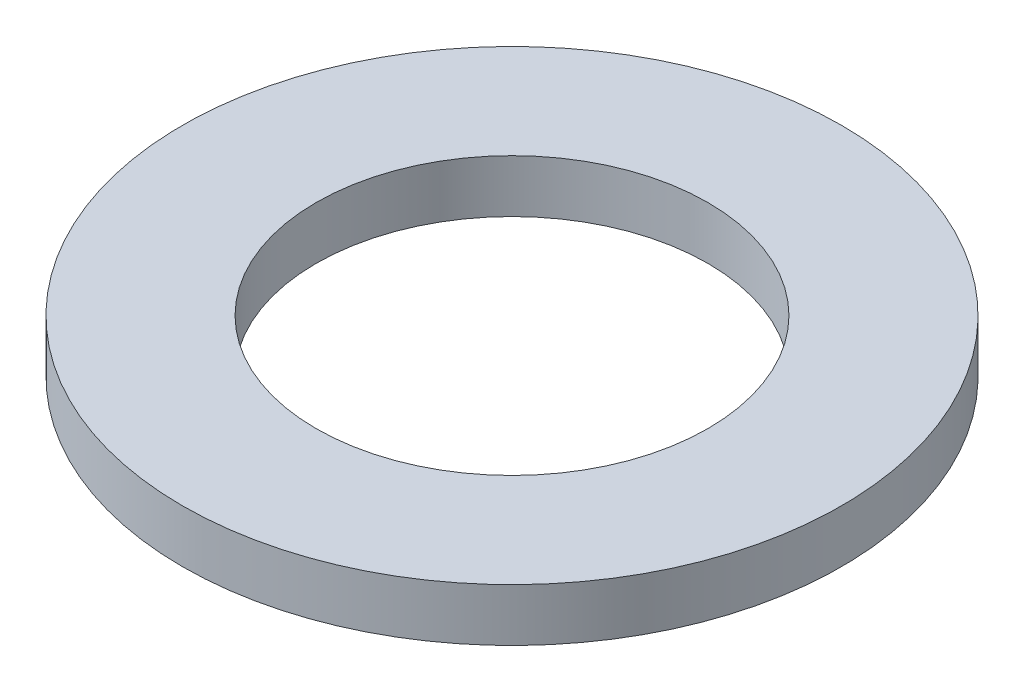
ISO-10303-21;
HEADER;
FILE_DESCRIPTION(('STEP AP214'),'2;1');
FILE_NAME('part.step','',(''),(''),'','','');
FILE_SCHEMA(('AUTOMOTIVE_DESIGN { 1 0 10303 214 1 1 1 1 }'));
ENDSEC;
DATA;
#1=APPLICATION_CONTEXT('core data for automotive mechanical design processes');
#2=APPLICATION_PROTOCOL_DEFINITION('international standard','automotive_design',2000,#1);
#3=PRODUCT_CONTEXT('',#1,'mechanical');
#4=PRODUCT('Part','Part','',(#3));
#5=PRODUCT_RELATED_PRODUCT_CATEGORY('part','',(#4));
#6=PRODUCT_DEFINITION_FORMATION('','',#4);
#7=PRODUCT_DEFINITION_CONTEXT('part definition',#1,'design');
#8=PRODUCT_DEFINITION('design','',#6,#7);
#9=PRODUCT_DEFINITION_SHAPE('','',#8);
#10=(LENGTH_UNIT() NAMED_UNIT(*) SI_UNIT(.MILLI.,.METRE.));
#11=(NAMED_UNIT(*) PLANE_ANGLE_UNIT() SI_UNIT($,.RADIAN.));
#12=(NAMED_UNIT(*) SI_UNIT($,.STERADIAN.) SOLID_ANGLE_UNIT());
#13=UNCERTAINTY_MEASURE_WITH_UNIT(LENGTH_MEASURE(1.E-05),#10,'distance_accuracy_value','');
#14=(GEOMETRIC_REPRESENTATION_CONTEXT(3) GLOBAL_UNCERTAINTY_ASSIGNED_CONTEXT((#13)) GLOBAL_UNIT_ASSIGNED_CONTEXT((#10,
#11,#12)) REPRESENTATION_CONTEXT('',''));
#15=CARTESIAN_POINT('',(0.,0.,0.));
#16=DIRECTION('',(0.,0.,1.));
#17=DIRECTION('',(1.,0.,0.));
#18=AXIS2_PLACEMENT_3D('',#15,#16,#17);
#19=CARTESIAN_POINT('',(0.,14.,0.));
#20=DIRECTION('',(0.,1.,0.));
#21=DIRECTION('',(0.,0.,1.));
#22=AXIS2_PLACEMENT_3D('',#19,#20,#21);
#23=PLANE('',#22);
#24=CARTESIAN_POINT('',(0.,14.,0.));
#25=DIRECTION('',(0.,1.,0.));
#26=DIRECTION('',(0.,0.,1.));
#27=AXIS2_PLACEMENT_3D('',#24,#25,#26);
#28=CIRCLE('',#27,87.5);
#29=CARTESIAN_POINT('',(0.,14.,87.5));
#30=VERTEX_POINT('',#29);
#31=EDGE_CURVE('E10',#30,#30,#28,.T.);
#32=ORIENTED_EDGE('',*,*,#31,.T.);
#33=EDGE_LOOP('',(#32));
#34=FACE_BOUND('',#33,.T.);
#35=CARTESIAN_POINT('',(0.,14.,0.));
#36=DIRECTION('',(0.,1.,0.));
#37=DIRECTION('',(0.,0.,1.));
#38=AXIS2_PLACEMENT_3D('',#35,#36,#37);
#39=CIRCLE('',#38,52.);
#40=CARTESIAN_POINT('',(0.,14.,52.));
#41=VERTEX_POINT('',#40);
#42=EDGE_CURVE('E39',#41,#41,#39,.T.);
#43=ORIENTED_EDGE('',*,*,#42,.F.);
#44=EDGE_LOOP('',(#43));
#45=FACE_BOUND('',#44,.T.);
#46=ADVANCED_FACE('F28',(#34,#45),#23,.T.);
#47=CARTESIAN_POINT('',(0.,0.,0.));
#48=DIRECTION('',(0.,1.,0.));
#49=DIRECTION('',(0.,0.,1.));
#50=AXIS2_PLACEMENT_3D('',#47,#48,#49);
#51=PLANE('',#50);
#52=CARTESIAN_POINT('',(0.,0.,0.));
#53=DIRECTION('',(0.,1.,0.));
#54=DIRECTION('',(0.,0.,1.));
#55=AXIS2_PLACEMENT_3D('',#52,#53,#54);
#56=CIRCLE('',#55,87.5);
#57=CARTESIAN_POINT('',(0.,0.,87.5));
#58=VERTEX_POINT('',#57);
#59=EDGE_CURVE('E35',#58,#58,#56,.T.);
#60=ORIENTED_EDGE('',*,*,#59,.F.);
#61=EDGE_LOOP('',(#60));
#62=FACE_BOUND('',#61,.T.);
#63=CARTESIAN_POINT('',(0.,0.,0.));
#64=DIRECTION('',(0.,1.,0.));
#65=DIRECTION('',(0.,0.,1.));
#66=AXIS2_PLACEMENT_3D('',#63,#64,#65);
#67=CIRCLE('',#66,52.);
#68=CARTESIAN_POINT('',(0.,0.,52.));
#69=VERTEX_POINT('',#68);
#70=EDGE_CURVE('E43',#69,#69,#67,.T.);
#71=ORIENTED_EDGE('',*,*,#70,.T.);
#72=EDGE_LOOP('',(#71));
#73=FACE_BOUND('',#72,.T.);
#74=ADVANCED_FACE('F49',(#62,#73),#51,.F.);
#75=CARTESIAN_POINT('',(0.,14.,0.));
#76=DIRECTION('',(0.,-1.,0.));
#77=DIRECTION('',(0.,0.,-1.));
#78=AXIS2_PLACEMENT_3D('',#75,#76,#77);
#79=CYLINDRICAL_SURFACE('',#78,87.5);
#80=ORIENTED_EDGE('',*,*,#31,.F.);
#81=EDGE_LOOP('',(#80));
#82=FACE_BOUND('',#81,.T.);
#83=ORIENTED_EDGE('',*,*,#59,.T.);
#84=EDGE_LOOP('',(#83));
#85=FACE_BOUND('',#84,.T.);
#86=ADVANCED_FACE('F30',(#82,#85),#79,.T.);
#87=CARTESIAN_POINT('',(0.,14.,0.));
#88=DIRECTION('',(0.,-1.,0.));
#89=DIRECTION('',(0.,0.,-1.));
#90=AXIS2_PLACEMENT_3D('',#87,#88,#89);
#91=CYLINDRICAL_SURFACE('',#90,52.);
#92=ORIENTED_EDGE('',*,*,#42,.T.);
#93=EDGE_LOOP('',(#92));
#94=FACE_BOUND('',#93,.T.);
#95=ORIENTED_EDGE('',*,*,#70,.F.);
#96=EDGE_LOOP('',(#95));
#97=FACE_BOUND('',#96,.T.);
#98=ADVANCED_FACE('F51',(#94,#97),#91,.F.);
#99=CLOSED_SHELL('',(#46,#74,#86,#98));
#100=MANIFOLD_SOLID_BREP('B2',#99);
#101=ADVANCED_BREP_SHAPE_REPRESENTATION('',(#18,#100),#14);
#102=SHAPE_DEFINITION_REPRESENTATION(#9,#101);
ENDSEC;
END-ISO-10303-21;
